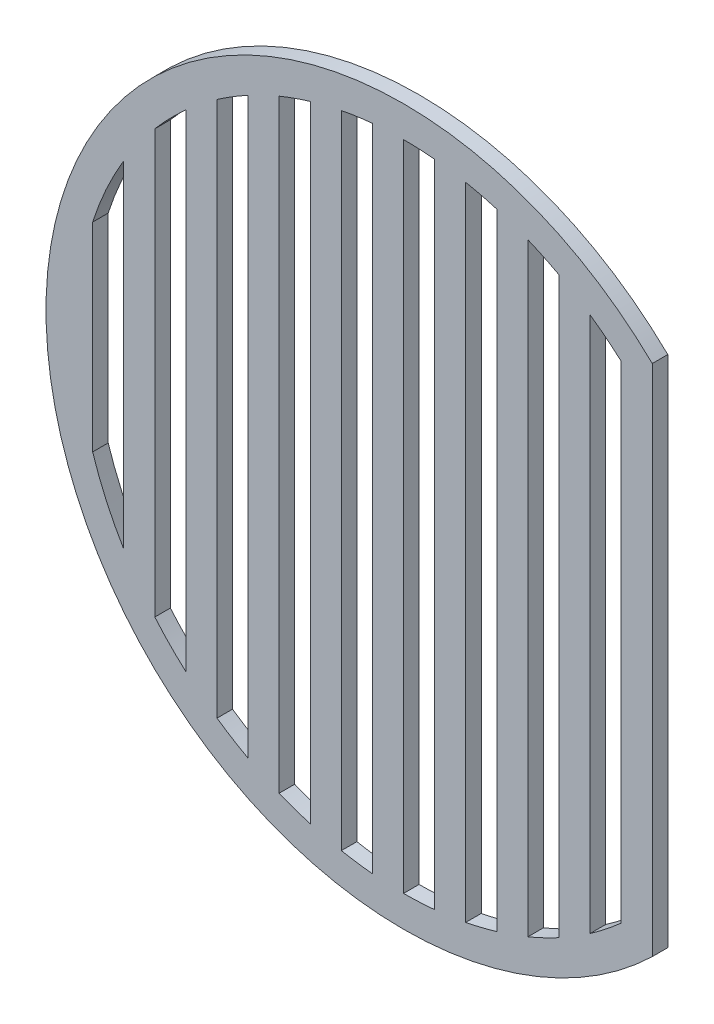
ISO-10303-21;
HEADER;
FILE_DESCRIPTION(('STEP AP214'),'2;1');
FILE_NAME('part.step','',(''),(''),'','','');
FILE_SCHEMA(('AUTOMOTIVE_DESIGN { 1 0 10303 214 1 1 1 1 }'));
ENDSEC;
DATA;
#1=APPLICATION_CONTEXT('core data for automotive mechanical design processes');
#2=APPLICATION_PROTOCOL_DEFINITION('international standard','automotive_design',2000,#1);
#3=PRODUCT_CONTEXT('',#1,'mechanical');
#4=PRODUCT('Part','Part','',(#3));
#5=PRODUCT_RELATED_PRODUCT_CATEGORY('part','',(#4));
#6=PRODUCT_DEFINITION_FORMATION('','',#4);
#7=PRODUCT_DEFINITION_CONTEXT('part definition',#1,'design');
#8=PRODUCT_DEFINITION('design','',#6,#7);
#9=PRODUCT_DEFINITION_SHAPE('','',#8);
#10=(LENGTH_UNIT() NAMED_UNIT(*) SI_UNIT(.MILLI.,.METRE.));
#11=(NAMED_UNIT(*) PLANE_ANGLE_UNIT() SI_UNIT($,.RADIAN.));
#12=(NAMED_UNIT(*) SI_UNIT($,.STERADIAN.) SOLID_ANGLE_UNIT());
#13=UNCERTAINTY_MEASURE_WITH_UNIT(LENGTH_MEASURE(1.E-05),#10,'distance_accuracy_value','');
#14=(GEOMETRIC_REPRESENTATION_CONTEXT(3) GLOBAL_UNCERTAINTY_ASSIGNED_CONTEXT((#13)) GLOBAL_UNIT_ASSIGNED_CONTEXT((#10,
#11,#12)) REPRESENTATION_CONTEXT('',''));
#15=CARTESIAN_POINT('',(0.,0.,0.));
#16=DIRECTION('',(0.,0.,1.));
#17=DIRECTION('',(1.,0.,0.));
#18=AXIS2_PLACEMENT_3D('',#15,#16,#17);
#19=CARTESIAN_POINT('',(0.,0.,3.175));
#20=DIRECTION('',(0.,0.,-1.));
#21=DIRECTION('',(-1.,0.,0.));
#22=AXIS2_PLACEMENT_3D('',#19,#20,#21);
#23=CYLINDRICAL_SURFACE('',#22,73.025);
#24=CARTESIAN_POINT('',(0.,0.,0.));
#25=DIRECTION('',(0.,0.,1.));
#26=DIRECTION('',(1.,0.,0.));
#27=AXIS2_PLACEMENT_3D('',#24,#25,#26);
#28=CIRCLE('',#27,73.025);
#29=CARTESIAN_POINT('',(50.8,52.4596094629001,0.));
#30=VERTEX_POINT('',#29);
#31=CARTESIAN_POINT('',(50.8,-52.4596094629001,0.));
#32=VERTEX_POINT('',#31);
#33=EDGE_CURVE('E563',#30,#32,#28,.T.);
#34=ORIENTED_EDGE('',*,*,#33,.T.);
#35=DIRECTION('',(0.,0.,-1.));
#36=VECTOR('',#35,1.);
#37=CARTESIAN_POINT('',(50.8,-52.4596094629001,3.175));
#38=LINE('',#37,#36);
#39=CARTESIAN_POINT('',(50.8,-52.4596094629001,3.175));
#40=VERTEX_POINT('',#39);
#41=EDGE_CURVE('E11',#40,#32,#38,.T.);
#42=ORIENTED_EDGE('',*,*,#41,.F.);
#43=CARTESIAN_POINT('',(0.,0.,3.175));
#44=DIRECTION('',(0.,0.,1.));
#45=DIRECTION('',(1.,0.,0.));
#46=AXIS2_PLACEMENT_3D('',#43,#44,#45);
#47=CIRCLE('',#46,73.025);
#48=CARTESIAN_POINT('',(50.8,52.4596094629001,3.175));
#49=VERTEX_POINT('',#48);
#50=EDGE_CURVE('E570',#49,#40,#47,.T.);
#51=ORIENTED_EDGE('',*,*,#50,.F.);
#52=DIRECTION('',(0.,0.,-1.));
#53=VECTOR('',#52,1.);
#54=CARTESIAN_POINT('',(50.8,52.4596094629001,3.175));
#55=LINE('',#54,#53);
#56=EDGE_CURVE('E40',#49,#30,#55,.T.);
#57=ORIENTED_EDGE('',*,*,#56,.T.);
#58=EDGE_LOOP('',(#34,#42,#51,#57));
#59=FACE_BOUND('',#58,.T.);
#60=ADVANCED_FACE('F33',(#59),#23,.T.);
#61=CARTESIAN_POINT('',(50.8,52.4596094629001,3.175));
#62=DIRECTION('',(-1.,0.,0.));
#63=DIRECTION('',(0.,0.,1.));
#64=AXIS2_PLACEMENT_3D('',#61,#62,#63);
#65=PLANE('',#64);
#66=DIRECTION('',(0.,1.,0.));
#67=VECTOR('',#66,1.);
#68=CARTESIAN_POINT('',(50.8,52.4596094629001,0.));
#69=LINE('',#68,#67);
#70=EDGE_CURVE('E574',#32,#30,#69,.T.);
#71=ORIENTED_EDGE('',*,*,#70,.T.);
#72=ORIENTED_EDGE('',*,*,#56,.F.);
#73=DIRECTION('',(0.,1.,0.));
#74=VECTOR('',#73,1.);
#75=CARTESIAN_POINT('',(50.8,52.4596094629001,3.175));
#76=LINE('',#75,#74);
#77=EDGE_CURVE('E573',#40,#49,#76,.T.);
#78=ORIENTED_EDGE('',*,*,#77,.F.);
#79=ORIENTED_EDGE('',*,*,#41,.T.);
#80=EDGE_LOOP('',(#71,#72,#78,#79));
#81=FACE_BOUND('',#80,.T.);
#82=ADVANCED_FACE('F586',(#81),#65,.F.);
#83=CARTESIAN_POINT('',(0.,0.,3.175));
#84=DIRECTION('',(0.,0.,1.));
#85=DIRECTION('',(1.,0.,0.));
#86=AXIS2_PLACEMENT_3D('',#83,#84,#85);
#87=PLANE('',#86);
#88=CARTESIAN_POINT('',(0.,0.,3.175));
#89=DIRECTION('',(0.,0.,1.));
#90=DIRECTION('',(1.,0.,0.));
#91=AXIS2_PLACEMENT_3D('',#88,#89,#90);
#92=CIRCLE('',#91,66.675);
#93=CARTESIAN_POINT('',(-57.15,34.3428758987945,3.175));
#94=VERTEX_POINT('',#93);
#95=CARTESIAN_POINT('',(-63.5,20.3299194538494,3.175));
#96=VERTEX_POINT('',#95);
#97=EDGE_CURVE('E47',#94,#96,#92,.T.);
#98=ORIENTED_EDGE('',*,*,#97,.F.);
#99=DIRECTION('',(0.,1.,0.));
#100=VECTOR('',#99,1.);
#101=CARTESIAN_POINT('',(-57.15,34.3428758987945,3.175));
#102=LINE('',#101,#100);
#103=CARTESIAN_POINT('',(-57.15,-34.3428758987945,3.175));
#104=VERTEX_POINT('',#103);
#105=EDGE_CURVE('E295',#104,#94,#102,.T.);
#106=ORIENTED_EDGE('',*,*,#105,.F.);
#107=CARTESIAN_POINT('',(0.,0.,3.175));
#108=DIRECTION('',(0.,0.,1.));
#109=DIRECTION('',(1.,0.,0.));
#110=AXIS2_PLACEMENT_3D('',#107,#108,#109);
#111=CIRCLE('',#110,66.675);
#112=CARTESIAN_POINT('',(-63.5,-20.3299194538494,3.175));
#113=VERTEX_POINT('',#112);
#114=EDGE_CURVE('E298',#113,#104,#111,.T.);
#115=ORIENTED_EDGE('',*,*,#114,.F.);
#116=DIRECTION('',(0.,-1.,0.));
#117=VECTOR('',#116,1.);
#118=CARTESIAN_POINT('',(-63.5,20.3299194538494,3.175));
#119=LINE('',#118,#117);
#120=EDGE_CURVE('E304',#96,#113,#119,.T.);
#121=ORIENTED_EDGE('',*,*,#120,.F.);
#122=EDGE_LOOP('',(#98,#106,#115,#121));
#123=FACE_BOUND('',#122,.T.);
#124=CARTESIAN_POINT('',(0.,0.,3.175));
#125=DIRECTION('',(0.,0.,1.));
#126=DIRECTION('',(1.,0.,0.));
#127=AXIS2_PLACEMENT_3D('',#124,#125,#126);
#128=CIRCLE('',#127,66.675);
#129=CARTESIAN_POINT('',(-44.45,49.6966107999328,3.175));
#130=VERTEX_POINT('',#129);
#131=CARTESIAN_POINT('',(-50.8,43.1846688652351,3.175));
#132=VERTEX_POINT('',#131);
#133=EDGE_CURVE('E310',#130,#132,#128,.T.);
#134=ORIENTED_EDGE('',*,*,#133,.F.);
#135=DIRECTION('',(0.,1.,0.));
#136=VECTOR('',#135,1.);
#137=CARTESIAN_POINT('',(-44.45,49.6966107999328,3.175));
#138=LINE('',#137,#136);
#139=CARTESIAN_POINT('',(-44.45,-49.6966107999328,3.175));
#140=VERTEX_POINT('',#139);
#141=EDGE_CURVE('E318',#140,#130,#138,.T.);
#142=ORIENTED_EDGE('',*,*,#141,.F.);
#143=CARTESIAN_POINT('',(0.,0.,3.175));
#144=DIRECTION('',(0.,0.,1.));
#145=DIRECTION('',(1.,0.,0.));
#146=AXIS2_PLACEMENT_3D('',#143,#144,#145);
#147=CIRCLE('',#146,66.675);
#148=CARTESIAN_POINT('',(-50.8,-43.184668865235,3.175));
#149=VERTEX_POINT('',#148);
#150=EDGE_CURVE('E332',#149,#140,#147,.T.);
#151=ORIENTED_EDGE('',*,*,#150,.F.);
#152=DIRECTION('',(0.,-1.,0.));
#153=VECTOR('',#152,1.);
#154=CARTESIAN_POINT('',(-50.8,43.1846688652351,3.175));
#155=LINE('',#154,#153);
#156=EDGE_CURVE('E329',#132,#149,#155,.T.);
#157=ORIENTED_EDGE('',*,*,#156,.F.);
#158=EDGE_LOOP('',(#134,#142,#151,#157));
#159=FACE_BOUND('',#158,.T.);
#160=CARTESIAN_POINT('',(0.,0.,3.175));
#161=DIRECTION('',(0.,0.,1.));
#162=DIRECTION('',(1.,0.,0.));
#163=AXIS2_PLACEMENT_3D('',#160,#161,#162);
#164=CIRCLE('',#163,66.675);
#165=CARTESIAN_POINT('',(-31.75,58.6301383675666,3.175));
#166=VERTEX_POINT('',#165);
#167=CARTESIAN_POINT('',(-38.1,54.7169592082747,3.175));
#168=VERTEX_POINT('',#167);
#169=EDGE_CURVE('E339',#166,#168,#164,.T.);
#170=ORIENTED_EDGE('',*,*,#169,.F.);
#171=DIRECTION('',(0.,1.,0.));
#172=VECTOR('',#171,1.);
#173=CARTESIAN_POINT('',(-31.75,58.6301383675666,3.175));
#174=LINE('',#173,#172);
#175=CARTESIAN_POINT('',(-31.75,-58.6301383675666,3.175));
#176=VERTEX_POINT('',#175);
#177=EDGE_CURVE('E350',#176,#166,#174,.T.);
#178=ORIENTED_EDGE('',*,*,#177,.F.);
#179=CARTESIAN_POINT('',(0.,0.,3.175));
#180=DIRECTION('',(0.,0.,1.));
#181=DIRECTION('',(1.,0.,0.));
#182=AXIS2_PLACEMENT_3D('',#179,#180,#181);
#183=CIRCLE('',#182,66.675);
#184=CARTESIAN_POINT('',(-38.1,-54.7169592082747,3.175));
#185=VERTEX_POINT('',#184);
#186=EDGE_CURVE('E364',#185,#176,#183,.T.);
#187=ORIENTED_EDGE('',*,*,#186,.F.);
#188=DIRECTION('',(0.,-1.,0.));
#189=VECTOR('',#188,1.);
#190=CARTESIAN_POINT('',(-38.1,54.7169592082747,3.175));
#191=LINE('',#190,#189);
#192=EDGE_CURVE('E361',#168,#185,#191,.T.);
#193=ORIENTED_EDGE('',*,*,#192,.F.);
#194=EDGE_LOOP('',(#170,#178,#187,#193));
#195=FACE_BOUND('',#194,.T.);
#196=CARTESIAN_POINT('',(0.,0.,3.175));
#197=DIRECTION('',(0.,0.,1.));
#198=DIRECTION('',(1.,0.,0.));
#199=AXIS2_PLACEMENT_3D('',#196,#197,#198);
#200=CIRCLE('',#199,66.675);
#201=CARTESIAN_POINT('',(-19.05,63.8956424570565,3.175));
#202=VERTEX_POINT('',#201);
#203=CARTESIAN_POINT('',(-25.4,61.6473488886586,3.175));
#204=VERTEX_POINT('',#203);
#205=EDGE_CURVE('E371',#202,#204,#200,.T.);
#206=ORIENTED_EDGE('',*,*,#205,.F.);
#207=DIRECTION('',(0.,1.,0.));
#208=VECTOR('',#207,1.);
#209=CARTESIAN_POINT('',(-19.05,63.8956424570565,3.175));
#210=LINE('',#209,#208);
#211=CARTESIAN_POINT('',(-19.05,-63.8956424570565,3.175));
#212=VERTEX_POINT('',#211);
#213=EDGE_CURVE('E382',#212,#202,#210,.T.);
#214=ORIENTED_EDGE('',*,*,#213,.F.);
#215=CARTESIAN_POINT('',(0.,0.,3.175));
#216=DIRECTION('',(0.,0.,1.));
#217=DIRECTION('',(1.,0.,0.));
#218=AXIS2_PLACEMENT_3D('',#215,#216,#217);
#219=CIRCLE('',#218,66.675);
#220=CARTESIAN_POINT('',(-25.4,-61.6473488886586,3.175));
#221=VERTEX_POINT('',#220);
#222=EDGE_CURVE('E396',#221,#212,#219,.T.);
#223=ORIENTED_EDGE('',*,*,#222,.F.);
#224=DIRECTION('',(0.,-1.,0.));
#225=VECTOR('',#224,1.);
#226=CARTESIAN_POINT('',(-25.4,61.6473488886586,3.175));
#227=LINE('',#226,#225);
#228=EDGE_CURVE('E393',#204,#221,#227,.T.);
#229=ORIENTED_EDGE('',*,*,#228,.F.);
#230=EDGE_LOOP('',(#206,#214,#223,#229));
#231=FACE_BOUND('',#230,.T.);
#232=CARTESIAN_POINT('',(0.,0.,3.175));
#233=DIRECTION('',(0.,0.,1.));
#234=DIRECTION('',(1.,0.,0.));
#235=AXIS2_PLACEMENT_3D('',#232,#233,#234);
#236=CIRCLE('',#235,66.675);
#237=CARTESIAN_POINT('',(-6.34999999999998,66.3719302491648,3.175));
#238=VERTEX_POINT('',#237);
#239=CARTESIAN_POINT('',(-12.7,65.4543018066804,3.175));
#240=VERTEX_POINT('',#239);
#241=EDGE_CURVE('E403',#238,#240,#236,.T.);
#242=ORIENTED_EDGE('',*,*,#241,.F.);
#243=DIRECTION('',(0.,1.,0.));
#244=VECTOR('',#243,1.);
#245=CARTESIAN_POINT('',(-6.34999999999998,66.3719302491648,3.175));
#246=LINE('',#245,#244);
#247=CARTESIAN_POINT('',(-6.34999999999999,-66.3719302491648,3.175));
#248=VERTEX_POINT('',#247);
#249=EDGE_CURVE('E414',#248,#238,#246,.T.);
#250=ORIENTED_EDGE('',*,*,#249,.F.);
#251=CARTESIAN_POINT('',(0.,0.,3.175));
#252=DIRECTION('',(0.,0.,1.));
#253=DIRECTION('',(1.,0.,0.));
#254=AXIS2_PLACEMENT_3D('',#251,#252,#253);
#255=CIRCLE('',#254,66.675);
#256=CARTESIAN_POINT('',(-12.7,-65.4543018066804,3.175));
#257=VERTEX_POINT('',#256);
#258=EDGE_CURVE('E428',#257,#248,#255,.T.);
#259=ORIENTED_EDGE('',*,*,#258,.F.);
#260=DIRECTION('',(0.,-1.,0.));
#261=VECTOR('',#260,1.);
#262=CARTESIAN_POINT('',(-12.7,65.4543018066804,3.175));
#263=LINE('',#262,#261);
#264=EDGE_CURVE('E425',#240,#257,#263,.T.);
#265=ORIENTED_EDGE('',*,*,#264,.F.);
#266=EDGE_LOOP('',(#242,#250,#259,#265));
#267=FACE_BOUND('',#266,.T.);
#268=CARTESIAN_POINT('',(0.,0.,3.175));
#269=DIRECTION('',(0.,0.,1.));
#270=DIRECTION('',(1.,0.,0.));
#271=AXIS2_PLACEMENT_3D('',#268,#269,#270);
#272=CIRCLE('',#271,66.675);
#273=CARTESIAN_POINT('',(6.35000000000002,66.3719302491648,3.175));
#274=VERTEX_POINT('',#273);
#275=CARTESIAN_POINT('',(0.,66.675,3.175));
#276=VERTEX_POINT('',#275);
#277=EDGE_CURVE('E435',#274,#276,#272,.T.);
#278=ORIENTED_EDGE('',*,*,#277,.F.);
#279=DIRECTION('',(0.,1.,0.));
#280=VECTOR('',#279,1.);
#281=CARTESIAN_POINT('',(6.35000000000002,66.3719302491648,3.175));
#282=LINE('',#281,#280);
#283=CARTESIAN_POINT('',(6.35000000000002,-66.3719302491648,3.175));
#284=VERTEX_POINT('',#283);
#285=EDGE_CURVE('E446',#284,#274,#282,.T.);
#286=ORIENTED_EDGE('',*,*,#285,.F.);
#287=CARTESIAN_POINT('',(0.,0.,3.175));
#288=DIRECTION('',(0.,0.,1.));
#289=DIRECTION('',(1.,0.,0.));
#290=AXIS2_PLACEMENT_3D('',#287,#288,#289);
#291=CIRCLE('',#290,66.675);
#292=CARTESIAN_POINT('',(0.,-66.675,3.175));
#293=VERTEX_POINT('',#292);
#294=EDGE_CURVE('E460',#293,#284,#291,.T.);
#295=ORIENTED_EDGE('',*,*,#294,.F.);
#296=DIRECTION('',(0.,-1.,0.));
#297=VECTOR('',#296,1.);
#298=CARTESIAN_POINT('',(0.,66.675,3.175));
#299=LINE('',#298,#297);
#300=EDGE_CURVE('E457',#276,#293,#299,.T.);
#301=ORIENTED_EDGE('',*,*,#300,.F.);
#302=EDGE_LOOP('',(#278,#286,#295,#301));
#303=FACE_BOUND('',#302,.T.);
#304=CARTESIAN_POINT('',(0.,0.,3.175));
#305=DIRECTION('',(0.,0.,1.));
#306=DIRECTION('',(1.,0.,0.));
#307=AXIS2_PLACEMENT_3D('',#304,#305,#306);
#308=CIRCLE('',#307,66.675);
#309=CARTESIAN_POINT('',(19.05,63.8956424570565,3.175));
#310=VERTEX_POINT('',#309);
#311=CARTESIAN_POINT('',(12.7,65.4543018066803,3.175));
#312=VERTEX_POINT('',#311);
#313=EDGE_CURVE('E467',#310,#312,#308,.T.);
#314=ORIENTED_EDGE('',*,*,#313,.F.);
#315=DIRECTION('',(0.,1.,0.));
#316=VECTOR('',#315,1.);
#317=CARTESIAN_POINT('',(19.05,63.8956424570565,3.175));
#318=LINE('',#317,#316);
#319=CARTESIAN_POINT('',(19.05,-63.8956424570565,3.175));
#320=VERTEX_POINT('',#319);
#321=EDGE_CURVE('E478',#320,#310,#318,.T.);
#322=ORIENTED_EDGE('',*,*,#321,.F.);
#323=CARTESIAN_POINT('',(0.,0.,3.175));
#324=DIRECTION('',(0.,0.,1.));
#325=DIRECTION('',(1.,0.,0.));
#326=AXIS2_PLACEMENT_3D('',#323,#324,#325);
#327=CIRCLE('',#326,66.675);
#328=CARTESIAN_POINT('',(12.7,-65.4543018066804,3.175));
#329=VERTEX_POINT('',#328);
#330=EDGE_CURVE('E492',#329,#320,#327,.T.);
#331=ORIENTED_EDGE('',*,*,#330,.F.);
#332=DIRECTION('',(0.,-1.,0.));
#333=VECTOR('',#332,1.);
#334=CARTESIAN_POINT('',(12.7,65.4543018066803,3.175));
#335=LINE('',#334,#333);
#336=EDGE_CURVE('E489',#312,#329,#335,.T.);
#337=ORIENTED_EDGE('',*,*,#336,.F.);
#338=EDGE_LOOP('',(#314,#322,#331,#337));
#339=FACE_BOUND('',#338,.T.);
#340=CARTESIAN_POINT('',(0.,0.,3.175));
#341=DIRECTION('',(0.,0.,1.));
#342=DIRECTION('',(1.,0.,0.));
#343=AXIS2_PLACEMENT_3D('',#340,#341,#342);
#344=CIRCLE('',#343,66.675);
#345=CARTESIAN_POINT('',(31.75,58.6301383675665,3.175));
#346=VERTEX_POINT('',#345);
#347=CARTESIAN_POINT('',(25.4,61.6473488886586,3.175));
#348=VERTEX_POINT('',#347);
#349=EDGE_CURVE('E499',#346,#348,#344,.T.);
#350=ORIENTED_EDGE('',*,*,#349,.F.);
#351=DIRECTION('',(0.,1.,0.));
#352=VECTOR('',#351,1.);
#353=CARTESIAN_POINT('',(31.75,58.6301383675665,3.175));
#354=LINE('',#353,#352);
#355=CARTESIAN_POINT('',(31.75,-58.6301383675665,3.175));
#356=VERTEX_POINT('',#355);
#357=EDGE_CURVE('E510',#356,#346,#354,.T.);
#358=ORIENTED_EDGE('',*,*,#357,.F.);
#359=CARTESIAN_POINT('',(0.,0.,3.175));
#360=DIRECTION('',(0.,0.,1.));
#361=DIRECTION('',(1.,0.,0.));
#362=AXIS2_PLACEMENT_3D('',#359,#360,#361);
#363=CIRCLE('',#362,66.675);
#364=CARTESIAN_POINT('',(25.4,-61.6473488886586,3.175));
#365=VERTEX_POINT('',#364);
#366=EDGE_CURVE('E524',#365,#356,#363,.T.);
#367=ORIENTED_EDGE('',*,*,#366,.F.);
#368=DIRECTION('',(0.,-1.,0.));
#369=VECTOR('',#368,1.);
#370=CARTESIAN_POINT('',(25.4,61.6473488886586,3.175));
#371=LINE('',#370,#369);
#372=EDGE_CURVE('E521',#348,#365,#371,.T.);
#373=ORIENTED_EDGE('',*,*,#372,.F.);
#374=EDGE_LOOP('',(#350,#358,#367,#373));
#375=FACE_BOUND('',#374,.T.);
#376=CARTESIAN_POINT('',(0.,0.,3.175));
#377=DIRECTION('',(0.,0.,1.));
#378=DIRECTION('',(1.,0.,0.));
#379=AXIS2_PLACEMENT_3D('',#376,#377,#378);
#380=CIRCLE('',#379,66.675);
#381=CARTESIAN_POINT('',(44.45,49.6966107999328,3.175));
#382=VERTEX_POINT('',#381);
#383=CARTESIAN_POINT('',(38.1,54.7169592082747,3.175));
#384=VERTEX_POINT('',#383);
#385=EDGE_CURVE('E531',#382,#384,#380,.T.);
#386=ORIENTED_EDGE('',*,*,#385,.F.);
#387=DIRECTION('',(0.,1.,0.));
#388=VECTOR('',#387,1.);
#389=CARTESIAN_POINT('',(44.45,49.6966107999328,3.175));
#390=LINE('',#389,#388);
#391=CARTESIAN_POINT('',(44.45,-49.6966107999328,3.175));
#392=VERTEX_POINT('',#391);
#393=EDGE_CURVE('E542',#392,#382,#390,.T.);
#394=ORIENTED_EDGE('',*,*,#393,.F.);
#395=CARTESIAN_POINT('',(0.,0.,3.175));
#396=DIRECTION('',(0.,0.,1.));
#397=DIRECTION('',(1.,0.,0.));
#398=AXIS2_PLACEMENT_3D('',#395,#396,#397);
#399=CIRCLE('',#398,66.675);
#400=CARTESIAN_POINT('',(38.1,-54.7169592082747,3.175));
#401=VERTEX_POINT('',#400);
#402=EDGE_CURVE('E556',#401,#392,#399,.T.);
#403=ORIENTED_EDGE('',*,*,#402,.F.);
#404=DIRECTION('',(0.,-1.,0.));
#405=VECTOR('',#404,1.);
#406=CARTESIAN_POINT('',(38.1,54.7169592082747,3.175));
#407=LINE('',#406,#405);
#408=EDGE_CURVE('E553',#384,#401,#407,.T.);
#409=ORIENTED_EDGE('',*,*,#408,.F.);
#410=EDGE_LOOP('',(#386,#394,#403,#409));
#411=FACE_BOUND('',#410,.T.);
#412=ORIENTED_EDGE('',*,*,#50,.T.);
#413=ORIENTED_EDGE('',*,*,#77,.T.);
#414=EDGE_LOOP('',(#412,#413));
#415=FACE_BOUND('',#414,.T.);
#416=ADVANCED_FACE('F588',(#123,#159,#195,#231,#267,#303,#339,#375,#411,#415),#87,.T.);
#417=CARTESIAN_POINT('',(0.,0.,0.));
#418=DIRECTION('',(0.,0.,1.));
#419=DIRECTION('',(1.,0.,0.));
#420=AXIS2_PLACEMENT_3D('',#417,#418,#419);
#421=PLANE('',#420);
#422=DIRECTION('',(0.,1.,0.));
#423=VECTOR('',#422,1.);
#424=CARTESIAN_POINT('',(-57.15,34.3428758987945,0.));
#425=LINE('',#424,#423);
#426=CARTESIAN_POINT('',(-57.15,-34.3428758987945,0.));
#427=VERTEX_POINT('',#426);
#428=CARTESIAN_POINT('',(-57.15,34.3428758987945,0.));
#429=VERTEX_POINT('',#428);
#430=EDGE_CURVE('E285',#427,#429,#425,.T.);
#431=ORIENTED_EDGE('',*,*,#430,.T.);
#432=CARTESIAN_POINT('',(0.,0.,0.));
#433=DIRECTION('',(0.,0.,1.));
#434=DIRECTION('',(1.,0.,0.));
#435=AXIS2_PLACEMENT_3D('',#432,#433,#434);
#436=CIRCLE('',#435,66.675);
#437=CARTESIAN_POINT('',(-63.5,20.3299194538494,0.));
#438=VERTEX_POINT('',#437);
#439=EDGE_CURVE('E279',#429,#438,#436,.T.);
#440=ORIENTED_EDGE('',*,*,#439,.T.);
#441=DIRECTION('',(0.,-1.,0.));
#442=VECTOR('',#441,1.);
#443=CARTESIAN_POINT('',(-63.5,20.3299194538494,0.));
#444=LINE('',#443,#442);
#445=CARTESIAN_POINT('',(-63.5,-20.3299194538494,0.));
#446=VERTEX_POINT('',#445);
#447=EDGE_CURVE('E288',#438,#446,#444,.T.);
#448=ORIENTED_EDGE('',*,*,#447,.T.);
#449=CARTESIAN_POINT('',(0.,0.,0.));
#450=DIRECTION('',(0.,0.,1.));
#451=DIRECTION('',(1.,0.,0.));
#452=AXIS2_PLACEMENT_3D('',#449,#450,#451);
#453=CIRCLE('',#452,66.675);
#454=EDGE_CURVE('E55',#446,#427,#453,.T.);
#455=ORIENTED_EDGE('',*,*,#454,.T.);
#456=EDGE_LOOP('',(#431,#440,#448,#455));
#457=FACE_BOUND('',#456,.T.);
#458=DIRECTION('',(0.,1.,0.));
#459=VECTOR('',#458,1.);
#460=CARTESIAN_POINT('',(-44.45,49.6966107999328,0.));
#461=LINE('',#460,#459);
#462=CARTESIAN_POINT('',(-44.45,-49.6966107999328,0.));
#463=VERTEX_POINT('',#462);
#464=CARTESIAN_POINT('',(-44.45,49.6966107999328,0.));
#465=VERTEX_POINT('',#464);
#466=EDGE_CURVE('E324',#463,#465,#461,.T.);
#467=ORIENTED_EDGE('',*,*,#466,.T.);
#468=CARTESIAN_POINT('',(0.,0.,0.));
#469=DIRECTION('',(0.,0.,1.));
#470=DIRECTION('',(1.,0.,0.));
#471=AXIS2_PLACEMENT_3D('',#468,#469,#470);
#472=CIRCLE('',#471,66.675);
#473=CARTESIAN_POINT('',(-50.8,43.1846688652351,0.));
#474=VERTEX_POINT('',#473);
#475=EDGE_CURVE('E314',#465,#474,#472,.T.);
#476=ORIENTED_EDGE('',*,*,#475,.T.);
#477=DIRECTION('',(0.,-1.,0.));
#478=VECTOR('',#477,1.);
#479=CARTESIAN_POINT('',(-50.8,43.1846688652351,0.));
#480=LINE('',#479,#478);
#481=CARTESIAN_POINT('',(-50.8,-43.184668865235,0.));
#482=VERTEX_POINT('',#481);
#483=EDGE_CURVE('E317',#474,#482,#480,.T.);
#484=ORIENTED_EDGE('',*,*,#483,.T.);
#485=CARTESIAN_POINT('',(0.,0.,0.));
#486=DIRECTION('',(0.,0.,1.));
#487=DIRECTION('',(1.,0.,0.));
#488=AXIS2_PLACEMENT_3D('',#485,#486,#487);
#489=CIRCLE('',#488,66.675);
#490=EDGE_CURVE('E321',#482,#463,#489,.T.);
#491=ORIENTED_EDGE('',*,*,#490,.T.);
#492=EDGE_LOOP('',(#467,#476,#484,#491));
#493=FACE_BOUND('',#492,.T.);
#494=DIRECTION('',(0.,1.,0.));
#495=VECTOR('',#494,1.);
#496=CARTESIAN_POINT('',(-31.75,58.6301383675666,0.));
#497=LINE('',#496,#495);
#498=CARTESIAN_POINT('',(-31.75,-58.6301383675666,0.));
#499=VERTEX_POINT('',#498);
#500=CARTESIAN_POINT('',(-31.75,58.6301383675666,0.));
#501=VERTEX_POINT('',#500);
#502=EDGE_CURVE('E356',#499,#501,#497,.T.);
#503=ORIENTED_EDGE('',*,*,#502,.T.);
#504=CARTESIAN_POINT('',(0.,0.,0.));
#505=DIRECTION('',(0.,0.,1.));
#506=DIRECTION('',(1.,0.,0.));
#507=AXIS2_PLACEMENT_3D('',#504,#505,#506);
#508=CIRCLE('',#507,66.675);
#509=CARTESIAN_POINT('',(-38.1,54.7169592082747,0.));
#510=VERTEX_POINT('',#509);
#511=EDGE_CURVE('E346',#501,#510,#508,.T.);
#512=ORIENTED_EDGE('',*,*,#511,.T.);
#513=DIRECTION('',(0.,-1.,0.));
#514=VECTOR('',#513,1.);
#515=CARTESIAN_POINT('',(-38.1,54.7169592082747,0.));
#516=LINE('',#515,#514);
#517=CARTESIAN_POINT('',(-38.1,-54.7169592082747,0.));
#518=VERTEX_POINT('',#517);
#519=EDGE_CURVE('E349',#510,#518,#516,.T.);
#520=ORIENTED_EDGE('',*,*,#519,.T.);
#521=CARTESIAN_POINT('',(0.,0.,0.));
#522=DIRECTION('',(0.,0.,1.));
#523=DIRECTION('',(1.,0.,0.));
#524=AXIS2_PLACEMENT_3D('',#521,#522,#523);
#525=CIRCLE('',#524,66.675);
#526=EDGE_CURVE('E353',#518,#499,#525,.T.);
#527=ORIENTED_EDGE('',*,*,#526,.T.);
#528=EDGE_LOOP('',(#503,#512,#520,#527));
#529=FACE_BOUND('',#528,.T.);
#530=DIRECTION('',(0.,1.,0.));
#531=VECTOR('',#530,1.);
#532=CARTESIAN_POINT('',(-19.05,63.8956424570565,0.));
#533=LINE('',#532,#531);
#534=CARTESIAN_POINT('',(-19.05,-63.8956424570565,0.));
#535=VERTEX_POINT('',#534);
#536=CARTESIAN_POINT('',(-19.05,63.8956424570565,0.));
#537=VERTEX_POINT('',#536);
#538=EDGE_CURVE('E388',#535,#537,#533,.T.);
#539=ORIENTED_EDGE('',*,*,#538,.T.);
#540=CARTESIAN_POINT('',(0.,0.,0.));
#541=DIRECTION('',(0.,0.,1.));
#542=DIRECTION('',(1.,0.,0.));
#543=AXIS2_PLACEMENT_3D('',#540,#541,#542);
#544=CIRCLE('',#543,66.675);
#545=CARTESIAN_POINT('',(-25.4,61.6473488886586,0.));
#546=VERTEX_POINT('',#545);
#547=EDGE_CURVE('E378',#537,#546,#544,.T.);
#548=ORIENTED_EDGE('',*,*,#547,.T.);
#549=DIRECTION('',(0.,-1.,0.));
#550=VECTOR('',#549,1.);
#551=CARTESIAN_POINT('',(-25.4,61.6473488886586,0.));
#552=LINE('',#551,#550);
#553=CARTESIAN_POINT('',(-25.4,-61.6473488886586,0.));
#554=VERTEX_POINT('',#553);
#555=EDGE_CURVE('E381',#546,#554,#552,.T.);
#556=ORIENTED_EDGE('',*,*,#555,.T.);
#557=CARTESIAN_POINT('',(0.,0.,0.));
#558=DIRECTION('',(0.,0.,1.));
#559=DIRECTION('',(1.,0.,0.));
#560=AXIS2_PLACEMENT_3D('',#557,#558,#559);
#561=CIRCLE('',#560,66.675);
#562=EDGE_CURVE('E385',#554,#535,#561,.T.);
#563=ORIENTED_EDGE('',*,*,#562,.T.);
#564=EDGE_LOOP('',(#539,#548,#556,#563));
#565=FACE_BOUND('',#564,.T.);
#566=DIRECTION('',(0.,1.,0.));
#567=VECTOR('',#566,1.);
#568=CARTESIAN_POINT('',(-6.34999999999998,66.3719302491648,0.));
#569=LINE('',#568,#567);
#570=CARTESIAN_POINT('',(-6.34999999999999,-66.3719302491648,0.));
#571=VERTEX_POINT('',#570);
#572=CARTESIAN_POINT('',(-6.34999999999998,66.3719302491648,0.));
#573=VERTEX_POINT('',#572);
#574=EDGE_CURVE('E420',#571,#573,#569,.T.);
#575=ORIENTED_EDGE('',*,*,#574,.T.);
#576=CARTESIAN_POINT('',(0.,0.,0.));
#577=DIRECTION('',(0.,0.,1.));
#578=DIRECTION('',(1.,0.,0.));
#579=AXIS2_PLACEMENT_3D('',#576,#577,#578);
#580=CIRCLE('',#579,66.675);
#581=CARTESIAN_POINT('',(-12.7,65.4543018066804,0.));
#582=VERTEX_POINT('',#581);
#583=EDGE_CURVE('E410',#573,#582,#580,.T.);
#584=ORIENTED_EDGE('',*,*,#583,.T.);
#585=DIRECTION('',(0.,-1.,0.));
#586=VECTOR('',#585,1.);
#587=CARTESIAN_POINT('',(-12.7,65.4543018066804,0.));
#588=LINE('',#587,#586);
#589=CARTESIAN_POINT('',(-12.7,-65.4543018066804,0.));
#590=VERTEX_POINT('',#589);
#591=EDGE_CURVE('E413',#582,#590,#588,.T.);
#592=ORIENTED_EDGE('',*,*,#591,.T.);
#593=CARTESIAN_POINT('',(0.,0.,0.));
#594=DIRECTION('',(0.,0.,1.));
#595=DIRECTION('',(1.,0.,0.));
#596=AXIS2_PLACEMENT_3D('',#593,#594,#595);
#597=CIRCLE('',#596,66.675);
#598=EDGE_CURVE('E417',#590,#571,#597,.T.);
#599=ORIENTED_EDGE('',*,*,#598,.T.);
#600=EDGE_LOOP('',(#575,#584,#592,#599));
#601=FACE_BOUND('',#600,.T.);
#602=DIRECTION('',(0.,1.,0.));
#603=VECTOR('',#602,1.);
#604=CARTESIAN_POINT('',(6.35000000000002,66.3719302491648,0.));
#605=LINE('',#604,#603);
#606=CARTESIAN_POINT('',(6.35000000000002,-66.3719302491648,0.));
#607=VERTEX_POINT('',#606);
#608=CARTESIAN_POINT('',(6.35000000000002,66.3719302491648,0.));
#609=VERTEX_POINT('',#608);
#610=EDGE_CURVE('E452',#607,#609,#605,.T.);
#611=ORIENTED_EDGE('',*,*,#610,.T.);
#612=CARTESIAN_POINT('',(0.,0.,0.));
#613=DIRECTION('',(0.,0.,1.));
#614=DIRECTION('',(1.,0.,0.));
#615=AXIS2_PLACEMENT_3D('',#612,#613,#614);
#616=CIRCLE('',#615,66.675);
#617=CARTESIAN_POINT('',(0.,66.675,0.));
#618=VERTEX_POINT('',#617);
#619=EDGE_CURVE('E442',#609,#618,#616,.T.);
#620=ORIENTED_EDGE('',*,*,#619,.T.);
#621=DIRECTION('',(0.,-1.,0.));
#622=VECTOR('',#621,1.);
#623=CARTESIAN_POINT('',(0.,66.675,0.));
#624=LINE('',#623,#622);
#625=CARTESIAN_POINT('',(0.,-66.675,0.));
#626=VERTEX_POINT('',#625);
#627=EDGE_CURVE('E445',#618,#626,#624,.T.);
#628=ORIENTED_EDGE('',*,*,#627,.T.);
#629=CARTESIAN_POINT('',(0.,0.,0.));
#630=DIRECTION('',(0.,0.,1.));
#631=DIRECTION('',(1.,0.,0.));
#632=AXIS2_PLACEMENT_3D('',#629,#630,#631);
#633=CIRCLE('',#632,66.675);
#634=EDGE_CURVE('E449',#626,#607,#633,.T.);
#635=ORIENTED_EDGE('',*,*,#634,.T.);
#636=EDGE_LOOP('',(#611,#620,#628,#635));
#637=FACE_BOUND('',#636,.T.);
#638=DIRECTION('',(0.,1.,0.));
#639=VECTOR('',#638,1.);
#640=CARTESIAN_POINT('',(19.05,63.8956424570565,0.));
#641=LINE('',#640,#639);
#642=CARTESIAN_POINT('',(19.05,-63.8956424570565,0.));
#643=VERTEX_POINT('',#642);
#644=CARTESIAN_POINT('',(19.05,63.8956424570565,0.));
#645=VERTEX_POINT('',#644);
#646=EDGE_CURVE('E484',#643,#645,#641,.T.);
#647=ORIENTED_EDGE('',*,*,#646,.T.);
#648=CARTESIAN_POINT('',(0.,0.,0.));
#649=DIRECTION('',(0.,0.,1.));
#650=DIRECTION('',(1.,0.,0.));
#651=AXIS2_PLACEMENT_3D('',#648,#649,#650);
#652=CIRCLE('',#651,66.675);
#653=CARTESIAN_POINT('',(12.7,65.4543018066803,0.));
#654=VERTEX_POINT('',#653);
#655=EDGE_CURVE('E474',#645,#654,#652,.T.);
#656=ORIENTED_EDGE('',*,*,#655,.T.);
#657=DIRECTION('',(0.,-1.,0.));
#658=VECTOR('',#657,1.);
#659=CARTESIAN_POINT('',(12.7,65.4543018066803,0.));
#660=LINE('',#659,#658);
#661=CARTESIAN_POINT('',(12.7,-65.4543018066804,0.));
#662=VERTEX_POINT('',#661);
#663=EDGE_CURVE('E477',#654,#662,#660,.T.);
#664=ORIENTED_EDGE('',*,*,#663,.T.);
#665=CARTESIAN_POINT('',(0.,0.,0.));
#666=DIRECTION('',(0.,0.,1.));
#667=DIRECTION('',(1.,0.,0.));
#668=AXIS2_PLACEMENT_3D('',#665,#666,#667);
#669=CIRCLE('',#668,66.675);
#670=EDGE_CURVE('E481',#662,#643,#669,.T.);
#671=ORIENTED_EDGE('',*,*,#670,.T.);
#672=EDGE_LOOP('',(#647,#656,#664,#671));
#673=FACE_BOUND('',#672,.T.);
#674=DIRECTION('',(0.,1.,0.));
#675=VECTOR('',#674,1.);
#676=CARTESIAN_POINT('',(31.75,58.6301383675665,0.));
#677=LINE('',#676,#675);
#678=CARTESIAN_POINT('',(31.75,-58.6301383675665,0.));
#679=VERTEX_POINT('',#678);
#680=CARTESIAN_POINT('',(31.75,58.6301383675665,0.));
#681=VERTEX_POINT('',#680);
#682=EDGE_CURVE('E516',#679,#681,#677,.T.);
#683=ORIENTED_EDGE('',*,*,#682,.T.);
#684=CARTESIAN_POINT('',(0.,0.,0.));
#685=DIRECTION('',(0.,0.,1.));
#686=DIRECTION('',(1.,0.,0.));
#687=AXIS2_PLACEMENT_3D('',#684,#685,#686);
#688=CIRCLE('',#687,66.675);
#689=CARTESIAN_POINT('',(25.4,61.6473488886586,0.));
#690=VERTEX_POINT('',#689);
#691=EDGE_CURVE('E506',#681,#690,#688,.T.);
#692=ORIENTED_EDGE('',*,*,#691,.T.);
#693=DIRECTION('',(0.,-1.,0.));
#694=VECTOR('',#693,1.);
#695=CARTESIAN_POINT('',(25.4,61.6473488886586,0.));
#696=LINE('',#695,#694);
#697=CARTESIAN_POINT('',(25.4,-61.6473488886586,0.));
#698=VERTEX_POINT('',#697);
#699=EDGE_CURVE('E509',#690,#698,#696,.T.);
#700=ORIENTED_EDGE('',*,*,#699,.T.);
#701=CARTESIAN_POINT('',(0.,0.,0.));
#702=DIRECTION('',(0.,0.,1.));
#703=DIRECTION('',(1.,0.,0.));
#704=AXIS2_PLACEMENT_3D('',#701,#702,#703);
#705=CIRCLE('',#704,66.675);
#706=EDGE_CURVE('E513',#698,#679,#705,.T.);
#707=ORIENTED_EDGE('',*,*,#706,.T.);
#708=EDGE_LOOP('',(#683,#692,#700,#707));
#709=FACE_BOUND('',#708,.T.);
#710=DIRECTION('',(0.,1.,0.));
#711=VECTOR('',#710,1.);
#712=CARTESIAN_POINT('',(44.45,49.6966107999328,0.));
#713=LINE('',#712,#711);
#714=CARTESIAN_POINT('',(44.45,-49.6966107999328,0.));
#715=VERTEX_POINT('',#714);
#716=CARTESIAN_POINT('',(44.45,49.6966107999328,0.));
#717=VERTEX_POINT('',#716);
#718=EDGE_CURVE('E548',#715,#717,#713,.T.);
#719=ORIENTED_EDGE('',*,*,#718,.T.);
#720=CARTESIAN_POINT('',(0.,0.,0.));
#721=DIRECTION('',(0.,0.,1.));
#722=DIRECTION('',(1.,0.,0.));
#723=AXIS2_PLACEMENT_3D('',#720,#721,#722);
#724=CIRCLE('',#723,66.675);
#725=CARTESIAN_POINT('',(38.1,54.7169592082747,0.));
#726=VERTEX_POINT('',#725);
#727=EDGE_CURVE('E538',#717,#726,#724,.T.);
#728=ORIENTED_EDGE('',*,*,#727,.T.);
#729=DIRECTION('',(0.,-1.,0.));
#730=VECTOR('',#729,1.);
#731=CARTESIAN_POINT('',(38.1,54.7169592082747,0.));
#732=LINE('',#731,#730);
#733=CARTESIAN_POINT('',(38.1,-54.7169592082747,0.));
#734=VERTEX_POINT('',#733);
#735=EDGE_CURVE('E541',#726,#734,#732,.T.);
#736=ORIENTED_EDGE('',*,*,#735,.T.);
#737=CARTESIAN_POINT('',(0.,0.,0.));
#738=DIRECTION('',(0.,0.,1.));
#739=DIRECTION('',(1.,0.,0.));
#740=AXIS2_PLACEMENT_3D('',#737,#738,#739);
#741=CIRCLE('',#740,66.675);
#742=EDGE_CURVE('E545',#734,#715,#741,.T.);
#743=ORIENTED_EDGE('',*,*,#742,.T.);
#744=EDGE_LOOP('',(#719,#728,#736,#743));
#745=FACE_BOUND('',#744,.T.);
#746=ORIENTED_EDGE('',*,*,#33,.F.);
#747=ORIENTED_EDGE('',*,*,#70,.F.);
#748=EDGE_LOOP('',(#746,#747));
#749=FACE_BOUND('',#748,.T.);
#750=ADVANCED_FACE('F292',(#457,#493,#529,#565,#601,#637,#673,#709,#745,#749),#421,.F.);
#751=CARTESIAN_POINT('',(0.,0.,0.));
#752=DIRECTION('',(0.,0.,1.));
#753=DIRECTION('',(1.,0.,0.));
#754=AXIS2_PLACEMENT_3D('',#751,#752,#753);
#755=CYLINDRICAL_SURFACE('',#754,66.675);
#756=ORIENTED_EDGE('',*,*,#385,.T.);
#757=DIRECTION('',(0.,0.,1.));
#758=VECTOR('',#757,1.);
#759=CARTESIAN_POINT('',(38.1,54.7169592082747,0.));
#760=LINE('',#759,#758);
#761=EDGE_CURVE('E551',#726,#384,#760,.T.);
#762=ORIENTED_EDGE('',*,*,#761,.F.);
#763=ORIENTED_EDGE('',*,*,#727,.F.);
#764=DIRECTION('',(0.,0.,1.));
#765=VECTOR('',#764,1.);
#766=CARTESIAN_POINT('',(44.45,49.6966107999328,0.));
#767=LINE('',#766,#765);
#768=EDGE_CURVE('E561',#717,#382,#767,.T.);
#769=ORIENTED_EDGE('',*,*,#768,.T.);
#770=EDGE_LOOP('',(#756,#762,#763,#769));
#771=FACE_BOUND('',#770,.T.);
#772=ADVANCED_FACE('F596',(#771),#755,.F.);
#773=CARTESIAN_POINT('',(44.45,49.6966107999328,0.));
#774=DIRECTION('',(1.,0.,0.));
#775=DIRECTION('',(0.,0.,-1.));
#776=AXIS2_PLACEMENT_3D('',#773,#774,#775);
#777=PLANE('',#776);
#778=ORIENTED_EDGE('',*,*,#393,.T.);
#779=ORIENTED_EDGE('',*,*,#768,.F.);
#780=ORIENTED_EDGE('',*,*,#718,.F.);
#781=DIRECTION('',(0.,0.,1.));
#782=VECTOR('',#781,1.);
#783=CARTESIAN_POINT('',(44.45,-49.6966107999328,0.));
#784=LINE('',#783,#782);
#785=EDGE_CURVE('E564',#715,#392,#784,.T.);
#786=ORIENTED_EDGE('',*,*,#785,.T.);
#787=EDGE_LOOP('',(#778,#779,#780,#786));
#788=FACE_BOUND('',#787,.T.);
#789=ADVANCED_FACE('F617',(#788),#777,.F.);
#790=CARTESIAN_POINT('',(0.,0.,0.));
#791=DIRECTION('',(0.,0.,1.));
#792=DIRECTION('',(1.,0.,0.));
#793=AXIS2_PLACEMENT_3D('',#790,#791,#792);
#794=CYLINDRICAL_SURFACE('',#793,66.675);
#795=ORIENTED_EDGE('',*,*,#402,.T.);
#796=ORIENTED_EDGE('',*,*,#785,.F.);
#797=ORIENTED_EDGE('',*,*,#742,.F.);
#798=DIRECTION('',(0.,0.,1.));
#799=VECTOR('',#798,1.);
#800=CARTESIAN_POINT('',(38.1,-54.7169592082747,0.));
#801=LINE('',#800,#799);
#802=EDGE_CURVE('E566',#734,#401,#801,.T.);
#803=ORIENTED_EDGE('',*,*,#802,.T.);
#804=EDGE_LOOP('',(#795,#796,#797,#803));
#805=FACE_BOUND('',#804,.T.);
#806=ADVANCED_FACE('F627',(#805),#794,.F.);
#807=CARTESIAN_POINT('',(38.1,54.7169592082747,0.));
#808=DIRECTION('',(-1.,0.,0.));
#809=DIRECTION('',(0.,0.,1.));
#810=AXIS2_PLACEMENT_3D('',#807,#808,#809);
#811=PLANE('',#810);
#812=ORIENTED_EDGE('',*,*,#408,.T.);
#813=ORIENTED_EDGE('',*,*,#802,.F.);
#814=ORIENTED_EDGE('',*,*,#735,.F.);
#815=ORIENTED_EDGE('',*,*,#761,.T.);
#816=EDGE_LOOP('',(#812,#813,#814,#815));
#817=FACE_BOUND('',#816,.T.);
#818=ADVANCED_FACE('F637',(#817),#811,.F.);
#819=CARTESIAN_POINT('',(0.,0.,0.));
#820=DIRECTION('',(0.,0.,1.));
#821=DIRECTION('',(1.,0.,0.));
#822=AXIS2_PLACEMENT_3D('',#819,#820,#821);
#823=CYLINDRICAL_SURFACE('',#822,66.675);
#824=ORIENTED_EDGE('',*,*,#349,.T.);
#825=DIRECTION('',(0.,0.,1.));
#826=VECTOR('',#825,1.);
#827=CARTESIAN_POINT('',(25.4,61.6473488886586,0.));
#828=LINE('',#827,#826);
#829=EDGE_CURVE('E519',#690,#348,#828,.T.);
#830=ORIENTED_EDGE('',*,*,#829,.F.);
#831=ORIENTED_EDGE('',*,*,#691,.F.);
#832=DIRECTION('',(0.,0.,1.));
#833=VECTOR('',#832,1.);
#834=CARTESIAN_POINT('',(31.75,58.6301383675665,0.));
#835=LINE('',#834,#833);
#836=EDGE_CURVE('E529',#681,#346,#835,.T.);
#837=ORIENTED_EDGE('',*,*,#836,.T.);
#838=EDGE_LOOP('',(#824,#830,#831,#837));
#839=FACE_BOUND('',#838,.T.);
#840=ADVANCED_FACE('F646',(#839),#823,.F.);
#841=CARTESIAN_POINT('',(31.75,58.6301383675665,0.));
#842=DIRECTION('',(1.,0.,0.));
#843=DIRECTION('',(0.,0.,-1.));
#844=AXIS2_PLACEMENT_3D('',#841,#842,#843);
#845=PLANE('',#844);
#846=ORIENTED_EDGE('',*,*,#357,.T.);
#847=ORIENTED_EDGE('',*,*,#836,.F.);
#848=ORIENTED_EDGE('',*,*,#682,.F.);
#849=DIRECTION('',(0.,0.,1.));
#850=VECTOR('',#849,1.);
#851=CARTESIAN_POINT('',(31.75,-58.6301383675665,0.));
#852=LINE('',#851,#850);
#853=EDGE_CURVE('E532',#679,#356,#852,.T.);
#854=ORIENTED_EDGE('',*,*,#853,.T.);
#855=EDGE_LOOP('',(#846,#847,#848,#854));
#856=FACE_BOUND('',#855,.T.);
#857=ADVANCED_FACE('F665',(#856),#845,.F.);
#858=CARTESIAN_POINT('',(0.,0.,0.));
#859=DIRECTION('',(0.,0.,1.));
#860=DIRECTION('',(1.,0.,0.));
#861=AXIS2_PLACEMENT_3D('',#858,#859,#860);
#862=CYLINDRICAL_SURFACE('',#861,66.675);
#863=ORIENTED_EDGE('',*,*,#366,.T.);
#864=ORIENTED_EDGE('',*,*,#853,.F.);
#865=ORIENTED_EDGE('',*,*,#706,.F.);
#866=DIRECTION('',(0.,0.,1.));
#867=VECTOR('',#866,1.);
#868=CARTESIAN_POINT('',(25.4,-61.6473488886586,0.));
#869=LINE('',#868,#867);
#870=EDGE_CURVE('E534',#698,#365,#869,.T.);
#871=ORIENTED_EDGE('',*,*,#870,.T.);
#872=EDGE_LOOP('',(#863,#864,#865,#871));
#873=FACE_BOUND('',#872,.T.);
#874=ADVANCED_FACE('F675',(#873),#862,.F.);
#875=CARTESIAN_POINT('',(25.4,61.6473488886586,0.));
#876=DIRECTION('',(-1.,0.,0.));
#877=DIRECTION('',(0.,0.,1.));
#878=AXIS2_PLACEMENT_3D('',#875,#876,#877);
#879=PLANE('',#878);
#880=ORIENTED_EDGE('',*,*,#372,.T.);
#881=ORIENTED_EDGE('',*,*,#870,.F.);
#882=ORIENTED_EDGE('',*,*,#699,.F.);
#883=ORIENTED_EDGE('',*,*,#829,.T.);
#884=EDGE_LOOP('',(#880,#881,#882,#883));
#885=FACE_BOUND('',#884,.T.);
#886=ADVANCED_FACE('F685',(#885),#879,.F.);
#887=CARTESIAN_POINT('',(0.,0.,0.));
#888=DIRECTION('',(0.,0.,1.));
#889=DIRECTION('',(1.,0.,0.));
#890=AXIS2_PLACEMENT_3D('',#887,#888,#889);
#891=CYLINDRICAL_SURFACE('',#890,66.675);
#892=ORIENTED_EDGE('',*,*,#313,.T.);
#893=DIRECTION('',(0.,0.,1.));
#894=VECTOR('',#893,1.);
#895=CARTESIAN_POINT('',(12.7,65.4543018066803,0.));
#896=LINE('',#895,#894);
#897=EDGE_CURVE('E487',#654,#312,#896,.T.);
#898=ORIENTED_EDGE('',*,*,#897,.F.);
#899=ORIENTED_EDGE('',*,*,#655,.F.);
#900=DIRECTION('',(0.,0.,1.));
#901=VECTOR('',#900,1.);
#902=CARTESIAN_POINT('',(19.05,63.8956424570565,0.));
#903=LINE('',#902,#901);
#904=EDGE_CURVE('E497',#645,#310,#903,.T.);
#905=ORIENTED_EDGE('',*,*,#904,.T.);
#906=EDGE_LOOP('',(#892,#898,#899,#905));
#907=FACE_BOUND('',#906,.T.);
#908=ADVANCED_FACE('F695',(#907),#891,.F.);
#909=CARTESIAN_POINT('',(19.05,63.8956424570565,0.));
#910=DIRECTION('',(1.,0.,0.));
#911=DIRECTION('',(0.,0.,-1.));
#912=AXIS2_PLACEMENT_3D('',#909,#910,#911);
#913=PLANE('',#912);
#914=ORIENTED_EDGE('',*,*,#321,.T.);
#915=ORIENTED_EDGE('',*,*,#904,.F.);
#916=ORIENTED_EDGE('',*,*,#646,.F.);
#917=DIRECTION('',(0.,0.,1.));
#918=VECTOR('',#917,1.);
#919=CARTESIAN_POINT('',(19.05,-63.8956424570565,0.));
#920=LINE('',#919,#918);
#921=EDGE_CURVE('E500',#643,#320,#920,.T.);
#922=ORIENTED_EDGE('',*,*,#921,.T.);
#923=EDGE_LOOP('',(#914,#915,#916,#922));
#924=FACE_BOUND('',#923,.T.);
#925=ADVANCED_FACE('F705',(#924),#913,.F.);
#926=CARTESIAN_POINT('',(0.,0.,0.));
#927=DIRECTION('',(0.,0.,1.));
#928=DIRECTION('',(1.,0.,0.));
#929=AXIS2_PLACEMENT_3D('',#926,#927,#928);
#930=CYLINDRICAL_SURFACE('',#929,66.675);
#931=ORIENTED_EDGE('',*,*,#330,.T.);
#932=ORIENTED_EDGE('',*,*,#921,.F.);
#933=ORIENTED_EDGE('',*,*,#670,.F.);
#934=DIRECTION('',(0.,0.,1.));
#935=VECTOR('',#934,1.);
#936=CARTESIAN_POINT('',(12.7,-65.4543018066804,0.));
#937=LINE('',#936,#935);
#938=EDGE_CURVE('E502',#662,#329,#937,.T.);
#939=ORIENTED_EDGE('',*,*,#938,.T.);
#940=EDGE_LOOP('',(#931,#932,#933,#939));
#941=FACE_BOUND('',#940,.T.);
#942=ADVANCED_FACE('F715',(#941),#930,.F.);
#943=CARTESIAN_POINT('',(12.7,65.4543018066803,0.));
#944=DIRECTION('',(-1.,0.,0.));
#945=DIRECTION('',(0.,0.,1.));
#946=AXIS2_PLACEMENT_3D('',#943,#944,#945);
#947=PLANE('',#946);
#948=ORIENTED_EDGE('',*,*,#336,.T.);
#949=ORIENTED_EDGE('',*,*,#938,.F.);
#950=ORIENTED_EDGE('',*,*,#663,.F.);
#951=ORIENTED_EDGE('',*,*,#897,.T.);
#952=EDGE_LOOP('',(#948,#949,#950,#951));
#953=FACE_BOUND('',#952,.T.);
#954=ADVANCED_FACE('F725',(#953),#947,.F.);
#955=CARTESIAN_POINT('',(0.,0.,0.));
#956=DIRECTION('',(0.,0.,1.));
#957=DIRECTION('',(1.,0.,0.));
#958=AXIS2_PLACEMENT_3D('',#955,#956,#957);
#959=CYLINDRICAL_SURFACE('',#958,66.675);
#960=ORIENTED_EDGE('',*,*,#277,.T.);
#961=DIRECTION('',(0.,0.,1.));
#962=VECTOR('',#961,1.);
#963=CARTESIAN_POINT('',(0.,66.675,0.));
#964=LINE('',#963,#962);
#965=EDGE_CURVE('E455',#618,#276,#964,.T.);
#966=ORIENTED_EDGE('',*,*,#965,.F.);
#967=ORIENTED_EDGE('',*,*,#619,.F.);
#968=DIRECTION('',(0.,0.,1.));
#969=VECTOR('',#968,1.);
#970=CARTESIAN_POINT('',(6.35000000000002,66.3719302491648,0.));
#971=LINE('',#970,#969);
#972=EDGE_CURVE('E465',#609,#274,#971,.T.);
#973=ORIENTED_EDGE('',*,*,#972,.T.);
#974=EDGE_LOOP('',(#960,#966,#967,#973));
#975=FACE_BOUND('',#974,.T.);
#976=ADVANCED_FACE('F735',(#975),#959,.F.);
#977=CARTESIAN_POINT('',(6.35000000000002,66.3719302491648,0.));
#978=DIRECTION('',(1.,0.,0.));
#979=DIRECTION('',(0.,0.,-1.));
#980=AXIS2_PLACEMENT_3D('',#977,#978,#979);
#981=PLANE('',#980);
#982=ORIENTED_EDGE('',*,*,#285,.T.);
#983=ORIENTED_EDGE('',*,*,#972,.F.);
#984=ORIENTED_EDGE('',*,*,#610,.F.);
#985=DIRECTION('',(0.,0.,1.));
#986=VECTOR('',#985,1.);
#987=CARTESIAN_POINT('',(6.35000000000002,-66.3719302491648,0.));
#988=LINE('',#987,#986);
#989=EDGE_CURVE('E468',#607,#284,#988,.T.);
#990=ORIENTED_EDGE('',*,*,#989,.T.);
#991=EDGE_LOOP('',(#982,#983,#984,#990));
#992=FACE_BOUND('',#991,.T.);
#993=ADVANCED_FACE('F745',(#992),#981,.F.);
#994=CARTESIAN_POINT('',(0.,0.,0.));
#995=DIRECTION('',(0.,0.,1.));
#996=DIRECTION('',(1.,0.,0.));
#997=AXIS2_PLACEMENT_3D('',#994,#995,#996);
#998=CYLINDRICAL_SURFACE('',#997,66.675);
#999=ORIENTED_EDGE('',*,*,#294,.T.);
#1000=ORIENTED_EDGE('',*,*,#989,.F.);
#1001=ORIENTED_EDGE('',*,*,#634,.F.);
#1002=DIRECTION('',(0.,0.,1.));
#1003=VECTOR('',#1002,1.);
#1004=CARTESIAN_POINT('',(0.,-66.675,0.));
#1005=LINE('',#1004,#1003);
#1006=EDGE_CURVE('E470',#626,#293,#1005,.T.);
#1007=ORIENTED_EDGE('',*,*,#1006,.T.);
#1008=EDGE_LOOP('',(#999,#1000,#1001,#1007));
#1009=FACE_BOUND('',#1008,.T.);
#1010=ADVANCED_FACE('F755',(#1009),#998,.F.);
#1011=CARTESIAN_POINT('',(0.,66.675,0.));
#1012=DIRECTION('',(-1.,0.,0.));
#1013=DIRECTION('',(0.,0.,1.));
#1014=AXIS2_PLACEMENT_3D('',#1011,#1012,#1013);
#1015=PLANE('',#1014);
#1016=ORIENTED_EDGE('',*,*,#300,.T.);
#1017=ORIENTED_EDGE('',*,*,#1006,.F.);
#1018=ORIENTED_EDGE('',*,*,#627,.F.);
#1019=ORIENTED_EDGE('',*,*,#965,.T.);
#1020=EDGE_LOOP('',(#1016,#1017,#1018,#1019));
#1021=FACE_BOUND('',#1020,.T.);
#1022=ADVANCED_FACE('F765',(#1021),#1015,.F.);
#1023=CARTESIAN_POINT('',(0.,0.,0.));
#1024=DIRECTION('',(0.,0.,1.));
#1025=DIRECTION('',(1.,0.,0.));
#1026=AXIS2_PLACEMENT_3D('',#1023,#1024,#1025);
#1027=CYLINDRICAL_SURFACE('',#1026,66.675);
#1028=ORIENTED_EDGE('',*,*,#241,.T.);
#1029=DIRECTION('',(0.,0.,1.));
#1030=VECTOR('',#1029,1.);
#1031=CARTESIAN_POINT('',(-12.7,65.4543018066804,0.));
#1032=LINE('',#1031,#1030);
#1033=EDGE_CURVE('E423',#582,#240,#1032,.T.);
#1034=ORIENTED_EDGE('',*,*,#1033,.F.);
#1035=ORIENTED_EDGE('',*,*,#583,.F.);
#1036=DIRECTION('',(0.,0.,1.));
#1037=VECTOR('',#1036,1.);
#1038=CARTESIAN_POINT('',(-6.34999999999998,66.3719302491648,0.));
#1039=LINE('',#1038,#1037);
#1040=EDGE_CURVE('E433',#573,#238,#1039,.T.);
#1041=ORIENTED_EDGE('',*,*,#1040,.T.);
#1042=EDGE_LOOP('',(#1028,#1034,#1035,#1041));
#1043=FACE_BOUND('',#1042,.T.);
#1044=ADVANCED_FACE('F775',(#1043),#1027,.F.);
#1045=CARTESIAN_POINT('',(-6.34999999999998,66.3719302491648,0.));
#1046=DIRECTION('',(1.,0.,0.));
#1047=DIRECTION('',(0.,1.,0.));
#1048=AXIS2_PLACEMENT_3D('',#1045,#1046,#1047);
#1049=PLANE('',#1048);
#1050=ORIENTED_EDGE('',*,*,#249,.T.);
#1051=ORIENTED_EDGE('',*,*,#1040,.F.);
#1052=ORIENTED_EDGE('',*,*,#574,.F.);
#1053=DIRECTION('',(0.,0.,1.));
#1054=VECTOR('',#1053,1.);
#1055=CARTESIAN_POINT('',(-6.34999999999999,-66.3719302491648,0.));
#1056=LINE('',#1055,#1054);
#1057=EDGE_CURVE('E436',#571,#248,#1056,.T.);
#1058=ORIENTED_EDGE('',*,*,#1057,.T.);
#1059=EDGE_LOOP('',(#1050,#1051,#1052,#1058));
#1060=FACE_BOUND('',#1059,.T.);
#1061=ADVANCED_FACE('F785',(#1060),#1049,.F.);
#1062=CARTESIAN_POINT('',(0.,0.,0.));
#1063=DIRECTION('',(0.,0.,1.));
#1064=DIRECTION('',(1.,0.,0.));
#1065=AXIS2_PLACEMENT_3D('',#1062,#1063,#1064);
#1066=CYLINDRICAL_SURFACE('',#1065,66.675);
#1067=ORIENTED_EDGE('',*,*,#258,.T.);
#1068=ORIENTED_EDGE('',*,*,#1057,.F.);
#1069=ORIENTED_EDGE('',*,*,#598,.F.);
#1070=DIRECTION('',(0.,0.,1.));
#1071=VECTOR('',#1070,1.);
#1072=CARTESIAN_POINT('',(-12.7,-65.4543018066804,0.));
#1073=LINE('',#1072,#1071);
#1074=EDGE_CURVE('E438',#590,#257,#1073,.T.);
#1075=ORIENTED_EDGE('',*,*,#1074,.T.);
#1076=EDGE_LOOP('',(#1067,#1068,#1069,#1075));
#1077=FACE_BOUND('',#1076,.T.);
#1078=ADVANCED_FACE('F795',(#1077),#1066,.F.);
#1079=CARTESIAN_POINT('',(-12.7,65.4543018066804,0.));
#1080=DIRECTION('',(-1.,0.,0.));
#1081=DIRECTION('',(0.,0.,1.));
#1082=AXIS2_PLACEMENT_3D('',#1079,#1080,#1081);
#1083=PLANE('',#1082);
#1084=ORIENTED_EDGE('',*,*,#264,.T.);
#1085=ORIENTED_EDGE('',*,*,#1074,.F.);
#1086=ORIENTED_EDGE('',*,*,#591,.F.);
#1087=ORIENTED_EDGE('',*,*,#1033,.T.);
#1088=EDGE_LOOP('',(#1084,#1085,#1086,#1087));
#1089=FACE_BOUND('',#1088,.T.);
#1090=ADVANCED_FACE('F805',(#1089),#1083,.F.);
#1091=CARTESIAN_POINT('',(0.,0.,0.));
#1092=DIRECTION('',(0.,0.,1.));
#1093=DIRECTION('',(1.,0.,0.));
#1094=AXIS2_PLACEMENT_3D('',#1091,#1092,#1093);
#1095=CYLINDRICAL_SURFACE('',#1094,66.675);
#1096=ORIENTED_EDGE('',*,*,#205,.T.);
#1097=DIRECTION('',(0.,0.,1.));
#1098=VECTOR('',#1097,1.);
#1099=CARTESIAN_POINT('',(-25.4,61.6473488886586,0.));
#1100=LINE('',#1099,#1098);
#1101=EDGE_CURVE('E391',#546,#204,#1100,.T.);
#1102=ORIENTED_EDGE('',*,*,#1101,.F.);
#1103=ORIENTED_EDGE('',*,*,#547,.F.);
#1104=DIRECTION('',(0.,0.,1.));
#1105=VECTOR('',#1104,1.);
#1106=CARTESIAN_POINT('',(-19.05,63.8956424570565,0.));
#1107=LINE('',#1106,#1105);
#1108=EDGE_CURVE('E401',#537,#202,#1107,.T.);
#1109=ORIENTED_EDGE('',*,*,#1108,.T.);
#1110=EDGE_LOOP('',(#1096,#1102,#1103,#1109));
#1111=FACE_BOUND('',#1110,.T.);
#1112=ADVANCED_FACE('F815',(#1111),#1095,.F.);
#1113=CARTESIAN_POINT('',(-19.05,63.8956424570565,0.));
#1114=DIRECTION('',(1.,0.,0.));
#1115=DIRECTION('',(0.,0.,-1.));
#1116=AXIS2_PLACEMENT_3D('',#1113,#1114,#1115);
#1117=PLANE('',#1116);
#1118=ORIENTED_EDGE('',*,*,#213,.T.);
#1119=ORIENTED_EDGE('',*,*,#1108,.F.);
#1120=ORIENTED_EDGE('',*,*,#538,.F.);
#1121=DIRECTION('',(0.,0.,1.));
#1122=VECTOR('',#1121,1.);
#1123=CARTESIAN_POINT('',(-19.05,-63.8956424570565,0.));
#1124=LINE('',#1123,#1122);
#1125=EDGE_CURVE('E404',#535,#212,#1124,.T.);
#1126=ORIENTED_EDGE('',*,*,#1125,.T.);
#1127=EDGE_LOOP('',(#1118,#1119,#1120,#1126));
#1128=FACE_BOUND('',#1127,.T.);
#1129=ADVANCED_FACE('F825',(#1128),#1117,.F.);
#1130=CARTESIAN_POINT('',(0.,0.,0.));
#1131=DIRECTION('',(0.,0.,1.));
#1132=DIRECTION('',(1.,0.,0.));
#1133=AXIS2_PLACEMENT_3D('',#1130,#1131,#1132);
#1134=CYLINDRICAL_SURFACE('',#1133,66.675);
#1135=ORIENTED_EDGE('',*,*,#222,.T.);
#1136=ORIENTED_EDGE('',*,*,#1125,.F.);
#1137=ORIENTED_EDGE('',*,*,#562,.F.);
#1138=DIRECTION('',(0.,0.,1.));
#1139=VECTOR('',#1138,1.);
#1140=CARTESIAN_POINT('',(-25.4,-61.6473488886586,0.));
#1141=LINE('',#1140,#1139);
#1142=EDGE_CURVE('E406',#554,#221,#1141,.T.);
#1143=ORIENTED_EDGE('',*,*,#1142,.T.);
#1144=EDGE_LOOP('',(#1135,#1136,#1137,#1143));
#1145=FACE_BOUND('',#1144,.T.);
#1146=ADVANCED_FACE('F835',(#1145),#1134,.F.);
#1147=CARTESIAN_POINT('',(-25.4,61.6473488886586,0.));
#1148=DIRECTION('',(-1.,0.,0.));
#1149=DIRECTION('',(0.,0.,1.));
#1150=AXIS2_PLACEMENT_3D('',#1147,#1148,#1149);
#1151=PLANE('',#1150);
#1152=ORIENTED_EDGE('',*,*,#228,.T.);
#1153=ORIENTED_EDGE('',*,*,#1142,.F.);
#1154=ORIENTED_EDGE('',*,*,#555,.F.);
#1155=ORIENTED_EDGE('',*,*,#1101,.T.);
#1156=EDGE_LOOP('',(#1152,#1153,#1154,#1155));
#1157=FACE_BOUND('',#1156,.T.);
#1158=ADVANCED_FACE('F845',(#1157),#1151,.F.);
#1159=CARTESIAN_POINT('',(0.,0.,0.));
#1160=DIRECTION('',(0.,0.,1.));
#1161=DIRECTION('',(1.,0.,0.));
#1162=AXIS2_PLACEMENT_3D('',#1159,#1160,#1161);
#1163=CYLINDRICAL_SURFACE('',#1162,66.675);
#1164=ORIENTED_EDGE('',*,*,#169,.T.);
#1165=DIRECTION('',(0.,0.,1.));
#1166=VECTOR('',#1165,1.);
#1167=CARTESIAN_POINT('',(-38.1,54.7169592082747,0.));
#1168=LINE('',#1167,#1166);
#1169=EDGE_CURVE('E359',#510,#168,#1168,.T.);
#1170=ORIENTED_EDGE('',*,*,#1169,.F.);
#1171=ORIENTED_EDGE('',*,*,#511,.F.);
#1172=DIRECTION('',(0.,0.,1.));
#1173=VECTOR('',#1172,1.);
#1174=CARTESIAN_POINT('',(-31.75,58.6301383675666,0.));
#1175=LINE('',#1174,#1173);
#1176=EDGE_CURVE('E369',#501,#166,#1175,.T.);
#1177=ORIENTED_EDGE('',*,*,#1176,.T.);
#1178=EDGE_LOOP('',(#1164,#1170,#1171,#1177));
#1179=FACE_BOUND('',#1178,.T.);
#1180=ADVANCED_FACE('F855',(#1179),#1163,.F.);
#1181=CARTESIAN_POINT('',(-31.75,58.6301383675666,0.));
#1182=DIRECTION('',(1.,0.,0.));
#1183=DIRECTION('',(0.,0.,-1.));
#1184=AXIS2_PLACEMENT_3D('',#1181,#1182,#1183);
#1185=PLANE('',#1184);
#1186=ORIENTED_EDGE('',*,*,#177,.T.);
#1187=ORIENTED_EDGE('',*,*,#1176,.F.);
#1188=ORIENTED_EDGE('',*,*,#502,.F.);
#1189=DIRECTION('',(0.,0.,1.));
#1190=VECTOR('',#1189,1.);
#1191=CARTESIAN_POINT('',(-31.75,-58.6301383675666,0.));
#1192=LINE('',#1191,#1190);
#1193=EDGE_CURVE('E372',#499,#176,#1192,.T.);
#1194=ORIENTED_EDGE('',*,*,#1193,.T.);
#1195=EDGE_LOOP('',(#1186,#1187,#1188,#1194));
#1196=FACE_BOUND('',#1195,.T.);
#1197=ADVANCED_FACE('F865',(#1196),#1185,.F.);
#1198=CARTESIAN_POINT('',(0.,0.,0.));
#1199=DIRECTION('',(0.,0.,1.));
#1200=DIRECTION('',(1.,0.,0.));
#1201=AXIS2_PLACEMENT_3D('',#1198,#1199,#1200);
#1202=CYLINDRICAL_SURFACE('',#1201,66.675);
#1203=ORIENTED_EDGE('',*,*,#186,.T.);
#1204=ORIENTED_EDGE('',*,*,#1193,.F.);
#1205=ORIENTED_EDGE('',*,*,#526,.F.);
#1206=DIRECTION('',(0.,0.,1.));
#1207=VECTOR('',#1206,1.);
#1208=CARTESIAN_POINT('',(-38.1,-54.7169592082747,0.));
#1209=LINE('',#1208,#1207);
#1210=EDGE_CURVE('E374',#518,#185,#1209,.T.);
#1211=ORIENTED_EDGE('',*,*,#1210,.T.);
#1212=EDGE_LOOP('',(#1203,#1204,#1205,#1211));
#1213=FACE_BOUND('',#1212,.T.);
#1214=ADVANCED_FACE('F875',(#1213),#1202,.F.);
#1215=CARTESIAN_POINT('',(-38.1,54.7169592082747,0.));
#1216=DIRECTION('',(-1.,0.,0.));
#1217=DIRECTION('',(0.,0.,1.));
#1218=AXIS2_PLACEMENT_3D('',#1215,#1216,#1217);
#1219=PLANE('',#1218);
#1220=ORIENTED_EDGE('',*,*,#192,.T.);
#1221=ORIENTED_EDGE('',*,*,#1210,.F.);
#1222=ORIENTED_EDGE('',*,*,#519,.F.);
#1223=ORIENTED_EDGE('',*,*,#1169,.T.);
#1224=EDGE_LOOP('',(#1220,#1221,#1222,#1223));
#1225=FACE_BOUND('',#1224,.T.);
#1226=ADVANCED_FACE('F885',(#1225),#1219,.F.);
#1227=CARTESIAN_POINT('',(0.,0.,0.));
#1228=DIRECTION('',(0.,0.,1.));
#1229=DIRECTION('',(1.,0.,0.));
#1230=AXIS2_PLACEMENT_3D('',#1227,#1228,#1229);
#1231=CYLINDRICAL_SURFACE('',#1230,66.675);
#1232=ORIENTED_EDGE('',*,*,#133,.T.);
#1233=DIRECTION('',(0.,0.,1.));
#1234=VECTOR('',#1233,1.);
#1235=CARTESIAN_POINT('',(-50.8,43.1846688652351,0.));
#1236=LINE('',#1235,#1234);
#1237=EDGE_CURVE('E327',#474,#132,#1236,.T.);
#1238=ORIENTED_EDGE('',*,*,#1237,.F.);
#1239=ORIENTED_EDGE('',*,*,#475,.F.);
#1240=DIRECTION('',(0.,0.,1.));
#1241=VECTOR('',#1240,1.);
#1242=CARTESIAN_POINT('',(-44.45,49.6966107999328,0.));
#1243=LINE('',#1242,#1241);
#1244=EDGE_CURVE('E337',#465,#130,#1243,.T.);
#1245=ORIENTED_EDGE('',*,*,#1244,.T.);
#1246=EDGE_LOOP('',(#1232,#1238,#1239,#1245));
#1247=FACE_BOUND('',#1246,.T.);
#1248=ADVANCED_FACE('F895',(#1247),#1231,.F.);
#1249=CARTESIAN_POINT('',(-44.45,49.6966107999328,0.));
#1250=DIRECTION('',(1.,0.,0.));
#1251=DIRECTION('',(0.,0.,-1.));
#1252=AXIS2_PLACEMENT_3D('',#1249,#1250,#1251);
#1253=PLANE('',#1252);
#1254=ORIENTED_EDGE('',*,*,#141,.T.);
#1255=ORIENTED_EDGE('',*,*,#1244,.F.);
#1256=ORIENTED_EDGE('',*,*,#466,.F.);
#1257=DIRECTION('',(0.,0.,1.));
#1258=VECTOR('',#1257,1.);
#1259=CARTESIAN_POINT('',(-44.45,-49.6966107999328,0.));
#1260=LINE('',#1259,#1258);
#1261=EDGE_CURVE('E340',#463,#140,#1260,.T.);
#1262=ORIENTED_EDGE('',*,*,#1261,.T.);
#1263=EDGE_LOOP('',(#1254,#1255,#1256,#1262));
#1264=FACE_BOUND('',#1263,.T.);
#1265=ADVANCED_FACE('F905',(#1264),#1253,.F.);
#1266=CARTESIAN_POINT('',(0.,0.,0.));
#1267=DIRECTION('',(0.,0.,1.));
#1268=DIRECTION('',(1.,0.,0.));
#1269=AXIS2_PLACEMENT_3D('',#1266,#1267,#1268);
#1270=CYLINDRICAL_SURFACE('',#1269,66.675);
#1271=ORIENTED_EDGE('',*,*,#150,.T.);
#1272=ORIENTED_EDGE('',*,*,#1261,.F.);
#1273=ORIENTED_EDGE('',*,*,#490,.F.);
#1274=DIRECTION('',(0.,0.,1.));
#1275=VECTOR('',#1274,1.);
#1276=CARTESIAN_POINT('',(-50.8,-43.184668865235,0.));
#1277=LINE('',#1276,#1275);
#1278=EDGE_CURVE('E342',#482,#149,#1277,.T.);
#1279=ORIENTED_EDGE('',*,*,#1278,.T.);
#1280=EDGE_LOOP('',(#1271,#1272,#1273,#1279));
#1281=FACE_BOUND('',#1280,.T.);
#1282=ADVANCED_FACE('F915',(#1281),#1270,.F.);
#1283=CARTESIAN_POINT('',(-50.8,43.1846688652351,0.));
#1284=DIRECTION('',(-1.,0.,0.));
#1285=DIRECTION('',(0.,0.,1.));
#1286=AXIS2_PLACEMENT_3D('',#1283,#1284,#1285);
#1287=PLANE('',#1286);
#1288=ORIENTED_EDGE('',*,*,#156,.T.);
#1289=ORIENTED_EDGE('',*,*,#1278,.F.);
#1290=ORIENTED_EDGE('',*,*,#483,.F.);
#1291=ORIENTED_EDGE('',*,*,#1237,.T.);
#1292=EDGE_LOOP('',(#1288,#1289,#1290,#1291));
#1293=FACE_BOUND('',#1292,.T.);
#1294=ADVANCED_FACE('F925',(#1293),#1287,.F.);
#1295=CARTESIAN_POINT('',(0.,0.,0.));
#1296=DIRECTION('',(0.,0.,1.));
#1297=DIRECTION('',(1.,0.,0.));
#1298=AXIS2_PLACEMENT_3D('',#1295,#1296,#1297);
#1299=CYLINDRICAL_SURFACE('',#1298,66.675);
#1300=ORIENTED_EDGE('',*,*,#97,.T.);
#1301=DIRECTION('',(0.,0.,1.));
#1302=VECTOR('',#1301,1.);
#1303=CARTESIAN_POINT('',(-63.5,20.3299194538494,0.));
#1304=LINE('',#1303,#1302);
#1305=EDGE_CURVE('E275',#438,#96,#1304,.T.);
#1306=ORIENTED_EDGE('',*,*,#1305,.F.);
#1307=ORIENTED_EDGE('',*,*,#439,.F.);
#1308=DIRECTION('',(0.,0.,1.));
#1309=VECTOR('',#1308,1.);
#1310=CARTESIAN_POINT('',(-57.15,34.3428758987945,0.));
#1311=LINE('',#1310,#1309);
#1312=EDGE_CURVE('E308',#429,#94,#1311,.T.);
#1313=ORIENTED_EDGE('',*,*,#1312,.T.);
#1314=EDGE_LOOP('',(#1300,#1306,#1307,#1313));
#1315=FACE_BOUND('',#1314,.T.);
#1316=ADVANCED_FACE('F277',(#1315),#1299,.F.);
#1317=CARTESIAN_POINT('',(-57.15,34.3428758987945,0.));
#1318=DIRECTION('',(1.,0.,0.));
#1319=DIRECTION('',(0.,0.,-1.));
#1320=AXIS2_PLACEMENT_3D('',#1317,#1318,#1319);
#1321=PLANE('',#1320);
#1322=ORIENTED_EDGE('',*,*,#105,.T.);
#1323=ORIENTED_EDGE('',*,*,#1312,.F.);
#1324=ORIENTED_EDGE('',*,*,#430,.F.);
#1325=DIRECTION('',(0.,0.,1.));
#1326=VECTOR('',#1325,1.);
#1327=CARTESIAN_POINT('',(-57.15,-34.3428758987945,0.));
#1328=LINE('',#1327,#1326);
#1329=EDGE_CURVE('E311',#427,#104,#1328,.T.);
#1330=ORIENTED_EDGE('',*,*,#1329,.T.);
#1331=EDGE_LOOP('',(#1322,#1323,#1324,#1330));
#1332=FACE_BOUND('',#1331,.T.);
#1333=ADVANCED_FACE('F944',(#1332),#1321,.F.);
#1334=CARTESIAN_POINT('',(0.,0.,0.));
#1335=DIRECTION('',(0.,0.,1.));
#1336=DIRECTION('',(1.,0.,0.));
#1337=AXIS2_PLACEMENT_3D('',#1334,#1335,#1336);
#1338=CYLINDRICAL_SURFACE('',#1337,66.675);
#1339=ORIENTED_EDGE('',*,*,#114,.T.);
#1340=ORIENTED_EDGE('',*,*,#1329,.F.);
#1341=ORIENTED_EDGE('',*,*,#454,.F.);
#1342=DIRECTION('',(0.,0.,1.));
#1343=VECTOR('',#1342,1.);
#1344=CARTESIAN_POINT('',(-63.5,-20.3299194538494,0.));
#1345=LINE('',#1344,#1343);
#1346=EDGE_CURVE('E284',#446,#113,#1345,.T.);
#1347=ORIENTED_EDGE('',*,*,#1346,.T.);
#1348=EDGE_LOOP('',(#1339,#1340,#1341,#1347));
#1349=FACE_BOUND('',#1348,.T.);
#1350=ADVANCED_FACE('F953',(#1349),#1338,.F.);
#1351=CARTESIAN_POINT('',(-63.5,20.3299194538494,0.));
#1352=DIRECTION('',(-1.,0.,0.));
#1353=DIRECTION('',(0.,0.,1.));
#1354=AXIS2_PLACEMENT_3D('',#1351,#1352,#1353);
#1355=PLANE('',#1354);
#1356=ORIENTED_EDGE('',*,*,#120,.T.);
#1357=ORIENTED_EDGE('',*,*,#1346,.F.);
#1358=ORIENTED_EDGE('',*,*,#447,.F.);
#1359=ORIENTED_EDGE('',*,*,#1305,.T.);
#1360=EDGE_LOOP('',(#1356,#1357,#1358,#1359));
#1361=FACE_BOUND('',#1360,.T.);
#1362=ADVANCED_FACE('F289',(#1361),#1355,.F.);
#1363=CLOSED_SHELL('',(#60,#82,#416,#750,#772,#789,#806,#818,#840,#857,#874,#886,#908,#925,#942,
#954,#976,#993,#1010,#1022,#1044,#1061,#1078,#1090,#1112,#1129,#1146,#1158,#1180,#1197,#1214,
#1226,#1248,#1265,#1282,#1294,#1316,#1333,#1350,#1362));
#1364=MANIFOLD_SOLID_BREP('B2',#1363);
#1365=ADVANCED_BREP_SHAPE_REPRESENTATION('',(#18,#1364),#14);
#1366=SHAPE_DEFINITION_REPRESENTATION(#9,#1365);
ENDSEC;
END-ISO-10303-21;
